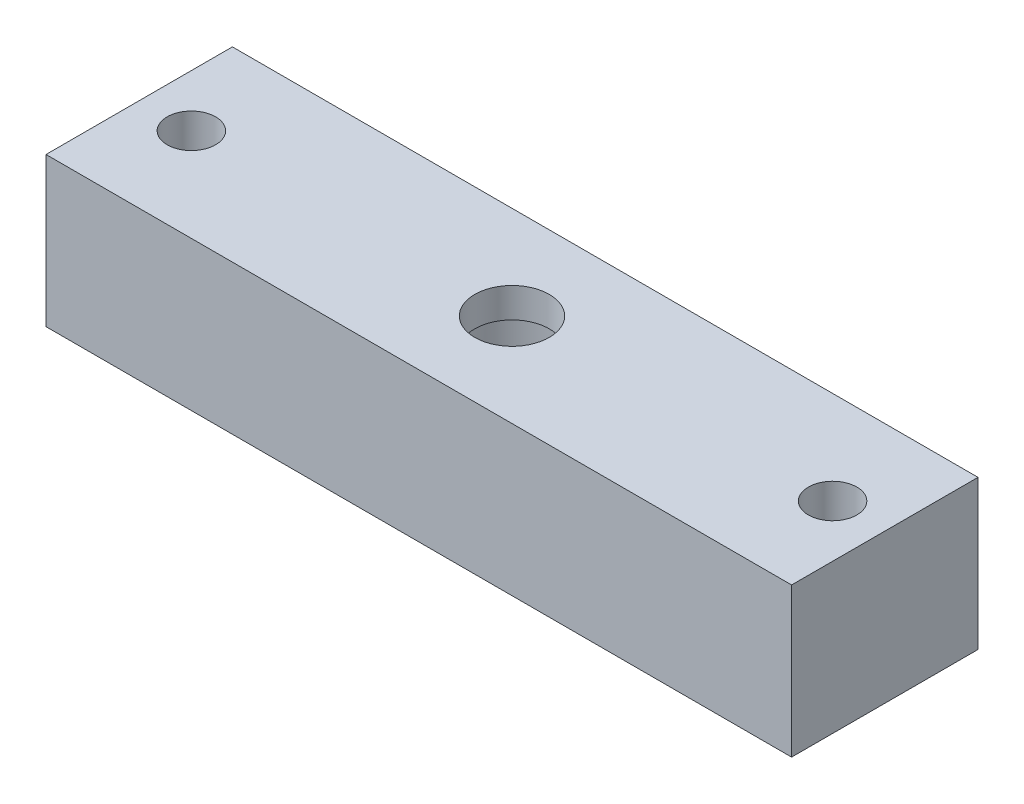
ISO-10303-21;
HEADER;
FILE_DESCRIPTION(('STEP AP214'),'2;1');
FILE_NAME('part.step','',(''),(''),'','','');
FILE_SCHEMA(('AUTOMOTIVE_DESIGN { 1 0 10303 214 1 1 1 1 }'));
ENDSEC;
DATA;
#1=APPLICATION_CONTEXT('core data for automotive mechanical design processes');
#2=APPLICATION_PROTOCOL_DEFINITION('international standard','automotive_design',2000,#1);
#3=PRODUCT_CONTEXT('',#1,'mechanical');
#4=PRODUCT('Part','Part','',(#3));
#5=PRODUCT_RELATED_PRODUCT_CATEGORY('part','',(#4));
#6=PRODUCT_DEFINITION_FORMATION('','',#4);
#7=PRODUCT_DEFINITION_CONTEXT('part definition',#1,'design');
#8=PRODUCT_DEFINITION('design','',#6,#7);
#9=PRODUCT_DEFINITION_SHAPE('','',#8);
#10=(LENGTH_UNIT() NAMED_UNIT(*) SI_UNIT(.MILLI.,.METRE.));
#11=(NAMED_UNIT(*) PLANE_ANGLE_UNIT() SI_UNIT($,.RADIAN.));
#12=(NAMED_UNIT(*) SI_UNIT($,.STERADIAN.) SOLID_ANGLE_UNIT());
#13=UNCERTAINTY_MEASURE_WITH_UNIT(LENGTH_MEASURE(1.E-05),#10,'distance_accuracy_value','');
#14=(GEOMETRIC_REPRESENTATION_CONTEXT(3) GLOBAL_UNCERTAINTY_ASSIGNED_CONTEXT((#13)) GLOBAL_UNIT_ASSIGNED_CONTEXT((#10,
#11,#12)) REPRESENTATION_CONTEXT('',''));
#15=CARTESIAN_POINT('',(0.,0.,0.));
#16=DIRECTION('',(0.,0.,1.));
#17=DIRECTION('',(1.,0.,0.));
#18=AXIS2_PLACEMENT_3D('',#15,#16,#17);
#19=CARTESIAN_POINT('',(0.,16.,0.));
#20=DIRECTION('',(0.,-1.,0.));
#21=DIRECTION('',(0.,0.,-1.));
#22=AXIS2_PLACEMENT_3D('',#19,#20,#21);
#23=CYLINDRICAL_SURFACE('',#22,8.);
#24=CARTESIAN_POINT('',(0.,16.,0.));
#25=DIRECTION('',(0.,-1.,0.));
#26=DIRECTION('',(0.,0.,-1.));
#27=AXIS2_PLACEMENT_3D('',#24,#25,#26);
#28=CIRCLE('',#27,8.);
#29=CARTESIAN_POINT('',(0.,16.,-8.));
#30=VERTEX_POINT('',#29);
#31=EDGE_CURVE('E112',#30,#30,#28,.T.);
#32=ORIENTED_EDGE('',*,*,#31,.F.);
#33=EDGE_LOOP('',(#32));
#34=FACE_BOUND('',#33,.T.);
#35=CARTESIAN_POINT('',(0.,0.,0.));
#36=DIRECTION('',(0.,-1.,0.));
#37=DIRECTION('',(0.,0.,-1.));
#38=AXIS2_PLACEMENT_3D('',#35,#36,#37);
#39=CIRCLE('',#38,8.);
#40=CARTESIAN_POINT('',(0.,0.,-8.));
#41=VERTEX_POINT('',#40);
#42=EDGE_CURVE('E109',#41,#41,#39,.T.);
#43=ORIENTED_EDGE('',*,*,#42,.T.);
#44=EDGE_LOOP('',(#43));
#45=FACE_BOUND('',#44,.T.);
#46=ADVANCED_FACE('F17',(#34,#45),#23,.F.);
#47=CARTESIAN_POINT('',(43.,6.,0.));
#48=DIRECTION('',(0.,-1.,0.));
#49=DIRECTION('',(0.,0.,-1.));
#50=AXIS2_PLACEMENT_3D('',#47,#48,#49);
#51=CYLINDRICAL_SURFACE('',#50,5.5);
#52=CARTESIAN_POINT('',(43.,6.,0.));
#53=DIRECTION('',(0.,-1.,0.));
#54=DIRECTION('',(0.,0.,-1.));
#55=AXIS2_PLACEMENT_3D('',#52,#53,#54);
#56=CIRCLE('',#55,5.5);
#57=CARTESIAN_POINT('',(43.,6.,-5.5));
#58=VERTEX_POINT('',#57);
#59=EDGE_CURVE('E20',#58,#58,#56,.T.);
#60=ORIENTED_EDGE('',*,*,#59,.F.);
#61=EDGE_LOOP('',(#60));
#62=FACE_BOUND('',#61,.T.);
#63=CARTESIAN_POINT('',(43.,0.,0.));
#64=DIRECTION('',(0.,-1.,0.));
#65=DIRECTION('',(0.,0.,-1.));
#66=AXIS2_PLACEMENT_3D('',#63,#64,#65);
#67=CIRCLE('',#66,5.5);
#68=CARTESIAN_POINT('',(43.,0.,-5.5));
#69=VERTEX_POINT('',#68);
#70=EDGE_CURVE('E106',#69,#69,#67,.T.);
#71=ORIENTED_EDGE('',*,*,#70,.T.);
#72=EDGE_LOOP('',(#71));
#73=FACE_BOUND('',#72,.T.);
#74=ADVANCED_FACE('F123',(#62,#73),#51,.F.);
#75=CARTESIAN_POINT('',(-43.,6.,0.));
#76=DIRECTION('',(0.,-1.,0.));
#77=DIRECTION('',(0.,0.,-1.));
#78=AXIS2_PLACEMENT_3D('',#75,#76,#77);
#79=CYLINDRICAL_SURFACE('',#78,5.5);
#80=CARTESIAN_POINT('',(-43.,6.,0.));
#81=DIRECTION('',(0.,-1.,0.));
#82=DIRECTION('',(0.,0.,-1.));
#83=AXIS2_PLACEMENT_3D('',#80,#81,#82);
#84=CIRCLE('',#83,5.5);
#85=CARTESIAN_POINT('',(-43.,6.,-5.5));
#86=VERTEX_POINT('',#85);
#87=EDGE_CURVE('E114',#86,#86,#84,.T.);
#88=ORIENTED_EDGE('',*,*,#87,.F.);
#89=EDGE_LOOP('',(#88));
#90=FACE_BOUND('',#89,.T.);
#91=CARTESIAN_POINT('',(-43.,0.,0.));
#92=DIRECTION('',(0.,-1.,0.));
#93=DIRECTION('',(0.,0.,-1.));
#94=AXIS2_PLACEMENT_3D('',#91,#92,#93);
#95=CIRCLE('',#94,5.5);
#96=CARTESIAN_POINT('',(-43.,0.,-5.5));
#97=VERTEX_POINT('',#96);
#98=EDGE_CURVE('E103',#97,#97,#95,.T.);
#99=ORIENTED_EDGE('',*,*,#98,.T.);
#100=EDGE_LOOP('',(#99));
#101=FACE_BOUND('',#100,.T.);
#102=ADVANCED_FACE('F126',(#90,#101),#79,.F.);
#103=CARTESIAN_POINT('',(43.,6.,0.));
#104=DIRECTION('',(0.,-1.,0.));
#105=DIRECTION('',(0.,0.,-1.));
#106=AXIS2_PLACEMENT_3D('',#103,#104,#105);
#107=PLANE('',#106);
#108=CARTESIAN_POINT('',(43.,6.,0.));
#109=DIRECTION('',(0.,1.,0.));
#110=DIRECTION('',(0.,0.,1.));
#111=AXIS2_PLACEMENT_3D('',#108,#109,#110);
#112=CIRCLE('',#111,3.25);
#113=CARTESIAN_POINT('',(43.,6.,3.25));
#114=VERTEX_POINT('',#113);
#115=EDGE_CURVE('E100',#114,#114,#112,.T.);
#116=ORIENTED_EDGE('',*,*,#115,.T.);
#117=EDGE_LOOP('',(#116));
#118=FACE_BOUND('',#117,.T.);
#119=ORIENTED_EDGE('',*,*,#59,.T.);
#120=EDGE_LOOP('',(#119));
#121=FACE_BOUND('',#120,.T.);
#122=ADVANCED_FACE('F121',(#118,#121),#107,.T.);
#123=CARTESIAN_POINT('',(-43.,6.,0.));
#124=DIRECTION('',(0.,-1.,0.));
#125=DIRECTION('',(0.,0.,-1.));
#126=AXIS2_PLACEMENT_3D('',#123,#124,#125);
#127=PLANE('',#126);
#128=CARTESIAN_POINT('',(-43.,6.,0.));
#129=DIRECTION('',(0.,1.,0.));
#130=DIRECTION('',(0.,0.,1.));
#131=AXIS2_PLACEMENT_3D('',#128,#129,#130);
#132=CIRCLE('',#131,3.25);
#133=CARTESIAN_POINT('',(-43.,6.,3.25));
#134=VERTEX_POINT('',#133);
#135=EDGE_CURVE('E97',#134,#134,#132,.T.);
#136=ORIENTED_EDGE('',*,*,#135,.T.);
#137=EDGE_LOOP('',(#136));
#138=FACE_BOUND('',#137,.T.);
#139=ORIENTED_EDGE('',*,*,#87,.T.);
#140=EDGE_LOOP('',(#139));
#141=FACE_BOUND('',#140,.T.);
#142=ADVANCED_FACE('F175',(#138,#141),#127,.T.);
#143=CARTESIAN_POINT('',(0.,16.,0.));
#144=DIRECTION('',(0.,-1.,0.));
#145=DIRECTION('',(0.,0.,-1.));
#146=AXIS2_PLACEMENT_3D('',#143,#144,#145);
#147=PLANE('',#146);
#148=CARTESIAN_POINT('',(0.,16.,0.));
#149=DIRECTION('',(0.,1.,0.));
#150=DIRECTION('',(0.,0.,1.));
#151=AXIS2_PLACEMENT_3D('',#148,#149,#150);
#152=CIRCLE('',#151,5.);
#153=CARTESIAN_POINT('',(0.,16.,5.));
#154=VERTEX_POINT('',#153);
#155=EDGE_CURVE('E69',#154,#154,#152,.T.);
#156=ORIENTED_EDGE('',*,*,#155,.T.);
#157=EDGE_LOOP('',(#156));
#158=FACE_BOUND('',#157,.T.);
#159=ORIENTED_EDGE('',*,*,#31,.T.);
#160=EDGE_LOOP('',(#159));
#161=FACE_BOUND('',#160,.T.);
#162=ADVANCED_FACE('F132',(#158,#161),#147,.T.);
#163=CARTESIAN_POINT('',(0.,0.,0.));
#164=DIRECTION('',(0.,1.,0.));
#165=DIRECTION('',(0.,0.,1.));
#166=AXIS2_PLACEMENT_3D('',#163,#164,#165);
#167=PLANE('',#166);
#168=DIRECTION('',(-1.,0.,0.));
#169=VECTOR('',#168,1.);
#170=CARTESIAN_POINT('',(-50.,0.,12.5));
#171=LINE('',#170,#169);
#172=CARTESIAN_POINT('',(50.,0.,12.5));
#173=VERTEX_POINT('',#172);
#174=CARTESIAN_POINT('',(-50.,0.,12.5));
#175=VERTEX_POINT('',#174);
#176=EDGE_CURVE('E94',#173,#175,#171,.T.);
#177=ORIENTED_EDGE('',*,*,#176,.T.);
#178=DIRECTION('',(0.,0.,-1.));
#179=VECTOR('',#178,1.);
#180=CARTESIAN_POINT('',(-50.,0.,-12.5));
#181=LINE('',#180,#179);
#182=CARTESIAN_POINT('',(-50.,0.,-12.5));
#183=VERTEX_POINT('',#182);
#184=EDGE_CURVE('E73',#175,#183,#181,.T.);
#185=ORIENTED_EDGE('',*,*,#184,.T.);
#186=DIRECTION('',(1.,0.,0.));
#187=VECTOR('',#186,1.);
#188=CARTESIAN_POINT('',(-50.,0.,-12.5));
#189=LINE('',#188,#187);
#190=CARTESIAN_POINT('',(50.,0.,-12.5));
#191=VERTEX_POINT('',#190);
#192=EDGE_CURVE('E55',#183,#191,#189,.T.);
#193=ORIENTED_EDGE('',*,*,#192,.T.);
#194=DIRECTION('',(0.,0.,1.));
#195=VECTOR('',#194,1.);
#196=CARTESIAN_POINT('',(50.,0.,-12.5));
#197=LINE('',#196,#195);
#198=EDGE_CURVE('E60',#191,#173,#197,.T.);
#199=ORIENTED_EDGE('',*,*,#198,.T.);
#200=EDGE_LOOP('',(#177,#185,#193,#199));
#201=FACE_BOUND('',#200,.T.);
#202=ORIENTED_EDGE('',*,*,#98,.F.);
#203=EDGE_LOOP('',(#202));
#204=FACE_BOUND('',#203,.T.);
#205=ORIENTED_EDGE('',*,*,#70,.F.);
#206=EDGE_LOOP('',(#205));
#207=FACE_BOUND('',#206,.T.);
#208=ORIENTED_EDGE('',*,*,#42,.F.);
#209=EDGE_LOOP('',(#208));
#210=FACE_BOUND('',#209,.T.);
#211=ADVANCED_FACE('F71',(#201,#204,#207,#210),#167,.F.);
#212=CARTESIAN_POINT('',(43.,0.,0.));
#213=DIRECTION('',(0.,1.,0.));
#214=DIRECTION('',(0.,0.,1.));
#215=AXIS2_PLACEMENT_3D('',#212,#213,#214);
#216=CYLINDRICAL_SURFACE('',#215,3.25);
#217=CARTESIAN_POINT('',(43.,20.,0.));
#218=DIRECTION('',(0.,1.,0.));
#219=DIRECTION('',(0.,0.,1.));
#220=AXIS2_PLACEMENT_3D('',#217,#218,#219);
#221=CIRCLE('',#220,3.25);
#222=CARTESIAN_POINT('',(43.,20.,3.25));
#223=VERTEX_POINT('',#222);
#224=EDGE_CURVE('E91',#223,#223,#221,.F.);
#225=ORIENTED_EDGE('',*,*,#224,.F.);
#226=EDGE_LOOP('',(#225));
#227=FACE_BOUND('',#226,.T.);
#228=ORIENTED_EDGE('',*,*,#115,.F.);
#229=EDGE_LOOP('',(#228));
#230=FACE_BOUND('',#229,.T.);
#231=ADVANCED_FACE('F131',(#227,#230),#216,.F.);
#232=CARTESIAN_POINT('',(-43.,0.,0.));
#233=DIRECTION('',(0.,1.,0.));
#234=DIRECTION('',(0.,0.,1.));
#235=AXIS2_PLACEMENT_3D('',#232,#233,#234);
#236=CYLINDRICAL_SURFACE('',#235,3.25);
#237=CARTESIAN_POINT('',(-43.,20.,0.));
#238=DIRECTION('',(0.,1.,0.));
#239=DIRECTION('',(0.,0.,1.));
#240=AXIS2_PLACEMENT_3D('',#237,#238,#239);
#241=CIRCLE('',#240,3.25);
#242=CARTESIAN_POINT('',(-43.,20.,3.25));
#243=VERTEX_POINT('',#242);
#244=EDGE_CURVE('E88',#243,#243,#241,.F.);
#245=ORIENTED_EDGE('',*,*,#244,.F.);
#246=EDGE_LOOP('',(#245));
#247=FACE_BOUND('',#246,.T.);
#248=ORIENTED_EDGE('',*,*,#135,.F.);
#249=EDGE_LOOP('',(#248));
#250=FACE_BOUND('',#249,.T.);
#251=ADVANCED_FACE('F165',(#247,#250),#236,.F.);
#252=CARTESIAN_POINT('',(0.,0.,0.));
#253=DIRECTION('',(0.,1.,0.));
#254=DIRECTION('',(0.,0.,1.));
#255=AXIS2_PLACEMENT_3D('',#252,#253,#254);
#256=CYLINDRICAL_SURFACE('',#255,5.);
#257=CARTESIAN_POINT('',(0.,20.,0.));
#258=DIRECTION('',(0.,1.,0.));
#259=DIRECTION('',(0.,0.,1.));
#260=AXIS2_PLACEMENT_3D('',#257,#258,#259);
#261=CIRCLE('',#260,5.);
#262=CARTESIAN_POINT('',(0.,20.,5.));
#263=VERTEX_POINT('',#262);
#264=EDGE_CURVE('E84',#263,#263,#261,.F.);
#265=ORIENTED_EDGE('',*,*,#264,.F.);
#266=EDGE_LOOP('',(#265));
#267=FACE_BOUND('',#266,.T.);
#268=ORIENTED_EDGE('',*,*,#155,.F.);
#269=EDGE_LOOP('',(#268));
#270=FACE_BOUND('',#269,.T.);
#271=ADVANCED_FACE('F162',(#267,#270),#256,.F.);
#272=CARTESIAN_POINT('',(50.,20.,-12.5));
#273=DIRECTION('',(-1.,0.,0.));
#274=DIRECTION('',(0.,0.,1.));
#275=AXIS2_PLACEMENT_3D('',#272,#273,#274);
#276=PLANE('',#275);
#277=DIRECTION('',(0.,1.,0.));
#278=VECTOR('',#277,1.);
#279=CARTESIAN_POINT('',(50.,20.,-12.5));
#280=LINE('',#279,#278);
#281=CARTESIAN_POINT('',(50.,20.,-12.5));
#282=VERTEX_POINT('',#281);
#283=EDGE_CURVE('E62',#191,#282,#280,.T.);
#284=ORIENTED_EDGE('',*,*,#283,.T.);
#285=DIRECTION('',(0.,0.,1.));
#286=VECTOR('',#285,1.);
#287=CARTESIAN_POINT('',(50.,20.,0.));
#288=LINE('',#287,#286);
#289=CARTESIAN_POINT('',(50.,20.,12.5));
#290=VERTEX_POINT('',#289);
#291=EDGE_CURVE('E87',#290,#282,#288,.F.);
#292=ORIENTED_EDGE('',*,*,#291,.F.);
#293=DIRECTION('',(0.,1.,0.));
#294=VECTOR('',#293,1.);
#295=CARTESIAN_POINT('',(50.,20.,12.5));
#296=LINE('',#295,#294);
#297=EDGE_CURVE('E65',#290,#173,#296,.F.);
#298=ORIENTED_EDGE('',*,*,#297,.T.);
#299=ORIENTED_EDGE('',*,*,#198,.F.);
#300=EDGE_LOOP('',(#284,#292,#298,#299));
#301=FACE_BOUND('',#300,.T.);
#302=ADVANCED_FACE('F61',(#301),#276,.F.);
#303=CARTESIAN_POINT('',(-50.,20.,-12.5));
#304=DIRECTION('',(0.,0.,1.));
#305=DIRECTION('',(1.,0.,0.));
#306=AXIS2_PLACEMENT_3D('',#303,#304,#305);
#307=PLANE('',#306);
#308=DIRECTION('',(0.,1.,0.));
#309=VECTOR('',#308,1.);
#310=CARTESIAN_POINT('',(-50.,20.,-12.5));
#311=LINE('',#310,#309);
#312=CARTESIAN_POINT('',(-50.,20.,-12.5));
#313=VERTEX_POINT('',#312);
#314=EDGE_CURVE('E75',#183,#313,#311,.T.);
#315=ORIENTED_EDGE('',*,*,#314,.T.);
#316=DIRECTION('',(1.,0.,0.));
#317=VECTOR('',#316,1.);
#318=CARTESIAN_POINT('',(0.,20.,-12.5));
#319=LINE('',#318,#317);
#320=EDGE_CURVE('E79',#282,#313,#319,.F.);
#321=ORIENTED_EDGE('',*,*,#320,.F.);
#322=ORIENTED_EDGE('',*,*,#283,.F.);
#323=ORIENTED_EDGE('',*,*,#192,.F.);
#324=EDGE_LOOP('',(#315,#321,#322,#323));
#325=FACE_BOUND('',#324,.T.);
#326=ADVANCED_FACE('F77',(#325),#307,.F.);
#327=CARTESIAN_POINT('',(-50.,20.,-12.5));
#328=DIRECTION('',(1.,0.,0.));
#329=DIRECTION('',(0.,0.,-1.));
#330=AXIS2_PLACEMENT_3D('',#327,#328,#329);
#331=PLANE('',#330);
#332=DIRECTION('',(0.,1.,0.));
#333=VECTOR('',#332,1.);
#334=CARTESIAN_POINT('',(-50.,20.,12.5));
#335=LINE('',#334,#333);
#336=CARTESIAN_POINT('',(-50.,20.,12.5));
#337=VERTEX_POINT('',#336);
#338=EDGE_CURVE('E35',#175,#337,#335,.T.);
#339=ORIENTED_EDGE('',*,*,#338,.T.);
#340=DIRECTION('',(0.,0.,1.));
#341=VECTOR('',#340,1.);
#342=CARTESIAN_POINT('',(-50.,20.,0.));
#343=LINE('',#342,#341);
#344=EDGE_CURVE('E26',#313,#337,#343,.T.);
#345=ORIENTED_EDGE('',*,*,#344,.F.);
#346=ORIENTED_EDGE('',*,*,#314,.F.);
#347=ORIENTED_EDGE('',*,*,#184,.F.);
#348=EDGE_LOOP('',(#339,#345,#346,#347));
#349=FACE_BOUND('',#348,.T.);
#350=ADVANCED_FACE('F150',(#349),#331,.F.);
#351=CARTESIAN_POINT('',(-50.,20.,12.5));
#352=DIRECTION('',(0.,0.,-1.));
#353=DIRECTION('',(-1.,0.,0.));
#354=AXIS2_PLACEMENT_3D('',#351,#352,#353);
#355=PLANE('',#354);
#356=ORIENTED_EDGE('',*,*,#297,.F.);
#357=DIRECTION('',(1.,0.,0.));
#358=VECTOR('',#357,1.);
#359=CARTESIAN_POINT('',(0.,20.,12.5));
#360=LINE('',#359,#358);
#361=EDGE_CURVE('E11',#337,#290,#360,.T.);
#362=ORIENTED_EDGE('',*,*,#361,.F.);
#363=ORIENTED_EDGE('',*,*,#338,.F.);
#364=ORIENTED_EDGE('',*,*,#176,.F.);
#365=EDGE_LOOP('',(#356,#362,#363,#364));
#366=FACE_BOUND('',#365,.T.);
#367=ADVANCED_FACE('F144',(#366),#355,.F.);
#368=CARTESIAN_POINT('',(0.,20.,0.));
#369=DIRECTION('',(0.,1.,0.));
#370=DIRECTION('',(0.,0.,1.));
#371=AXIS2_PLACEMENT_3D('',#368,#369,#370);
#372=PLANE('',#371);
#373=ORIENTED_EDGE('',*,*,#344,.T.);
#374=ORIENTED_EDGE('',*,*,#361,.T.);
#375=ORIENTED_EDGE('',*,*,#291,.T.);
#376=ORIENTED_EDGE('',*,*,#320,.T.);
#377=EDGE_LOOP('',(#373,#374,#375,#376));
#378=FACE_BOUND('',#377,.T.);
#379=ORIENTED_EDGE('',*,*,#264,.T.);
#380=EDGE_LOOP('',(#379));
#381=FACE_BOUND('',#380,.T.);
#382=ORIENTED_EDGE('',*,*,#244,.T.);
#383=EDGE_LOOP('',(#382));
#384=FACE_BOUND('',#383,.T.);
#385=ORIENTED_EDGE('',*,*,#224,.T.);
#386=EDGE_LOOP('',(#385));
#387=FACE_BOUND('',#386,.T.);
#388=ADVANCED_FACE('F142',(#378,#381,#384,#387),#372,.T.);
#389=CLOSED_SHELL('',(#46,#74,#102,#122,#142,#162,#211,#231,#251,#271,#302,#326,#350,#367,#388));
#390=MANIFOLD_SOLID_BREP('B1',#389);
#391=ADVANCED_BREP_SHAPE_REPRESENTATION('',(#18,#390),#14);
#392=SHAPE_DEFINITION_REPRESENTATION(#9,#391);
ENDSEC;
END-ISO-10303-21;
